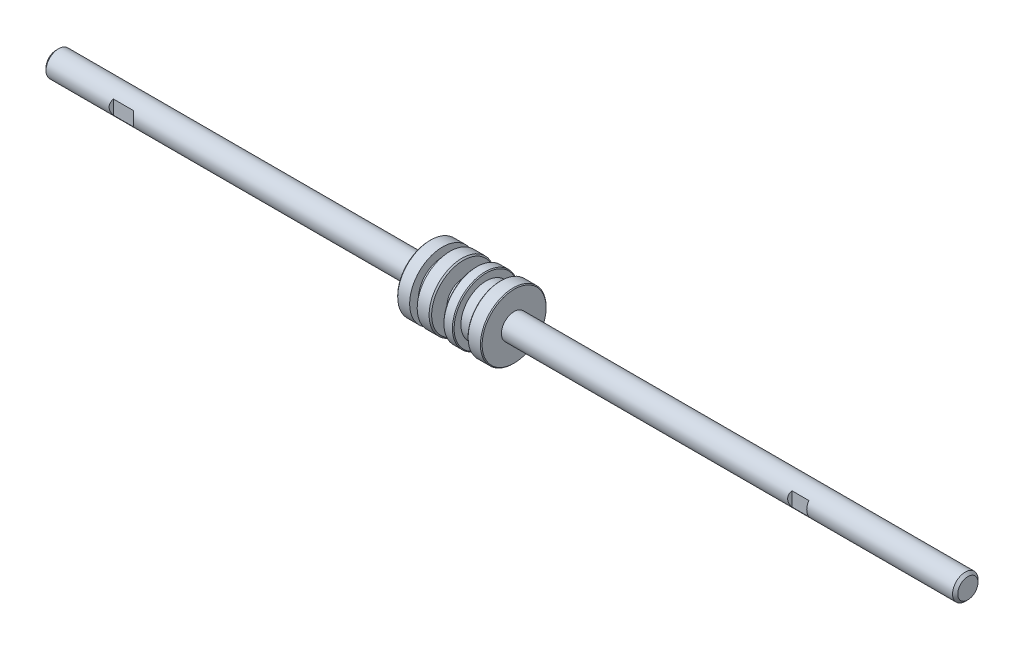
ISO-10303-21;
HEADER;
FILE_DESCRIPTION(('STEP AP214'),'2;1');
FILE_NAME('part.step','',(''),(''),'','','');
FILE_SCHEMA(('AUTOMOTIVE_DESIGN { 1 0 10303 214 1 1 1 1 }'));
ENDSEC;
DATA;
#1=APPLICATION_CONTEXT('core data for automotive mechanical design processes');
#2=APPLICATION_PROTOCOL_DEFINITION('international standard','automotive_design',2000,#1);
#3=PRODUCT_CONTEXT('',#1,'mechanical');
#4=PRODUCT('Part','Part','',(#3));
#5=PRODUCT_RELATED_PRODUCT_CATEGORY('part','',(#4));
#6=PRODUCT_DEFINITION_FORMATION('','',#4);
#7=PRODUCT_DEFINITION_CONTEXT('part definition',#1,'design');
#8=PRODUCT_DEFINITION('design','',#6,#7);
#9=PRODUCT_DEFINITION_SHAPE('','',#8);
#10=(LENGTH_UNIT() NAMED_UNIT(*) SI_UNIT(.MILLI.,.METRE.));
#11=(NAMED_UNIT(*) PLANE_ANGLE_UNIT() SI_UNIT($,.RADIAN.));
#12=(NAMED_UNIT(*) SI_UNIT($,.STERADIAN.) SOLID_ANGLE_UNIT());
#13=UNCERTAINTY_MEASURE_WITH_UNIT(LENGTH_MEASURE(1.E-05),#10,'distance_accuracy_value','');
#14=(GEOMETRIC_REPRESENTATION_CONTEXT(3) GLOBAL_UNCERTAINTY_ASSIGNED_CONTEXT((#13)) GLOBAL_UNIT_ASSIGNED_CONTEXT((#10,
#11,#12)) REPRESENTATION_CONTEXT('',''));
#15=CARTESIAN_POINT('',(0.,0.,0.));
#16=DIRECTION('',(0.,0.,1.));
#17=DIRECTION('',(1.,0.,0.));
#18=AXIS2_PLACEMENT_3D('',#15,#16,#17);
#19=CARTESIAN_POINT('',(0.,0.,0.));
#20=DIRECTION('',(1.,0.,0.));
#21=DIRECTION('',(0.,0.,-1.));
#22=AXIS2_PLACEMENT_3D('',#19,#20,#21);
#23=PLANE('',#22);
#24=CARTESIAN_POINT('',(0.,0.,0.));
#25=DIRECTION('',(1.,0.,0.));
#26=DIRECTION('',(0.,0.,-1.));
#27=AXIS2_PLACEMENT_3D('',#24,#25,#26);
#28=CIRCLE('',#27,2.38649999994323);
#29=CARTESIAN_POINT('',(0.,0.,-2.38649999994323));
#30=VERTEX_POINT('',#29);
#31=EDGE_CURVE('E20',#30,#30,#28,.T.);
#32=ORIENTED_EDGE('',*,*,#31,.F.);
#33=EDGE_LOOP('',(#32));
#34=FACE_BOUND('',#33,.T.);
#35=ADVANCED_FACE('F17',(#34),#23,.F.);
#36=CARTESIAN_POINT('',(20.8,-2.5,-2.5));
#37=DIRECTION('',(0.707106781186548,0.,0.707106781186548));
#38=DIRECTION('',(0.707106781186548,0.,-0.707106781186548));
#39=AXIS2_PLACEMENT_3D('',#36,#37,#38);
#40=PLANE('',#39);
#41=CARTESIAN_POINT('',(18.3,0.,0.));
#42=DIRECTION('',(0.707106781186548,0.,0.707106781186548));
#43=DIRECTION('',(-0.707106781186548,0.,0.707106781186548));
#44=AXIS2_PLACEMENT_3D('',#41,#42,#43);
#45=ELLIPSE('',#44,4.24264068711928,3.);
#46=CARTESIAN_POINT('',(20.8,-1.6583123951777,-2.5));
#47=VERTEX_POINT('',#46);
#48=CARTESIAN_POINT('',(20.8,1.6583123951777,-2.5));
#49=VERTEX_POINT('',#48);
#50=EDGE_CURVE('E105',#47,#49,#45,.T.);
#51=ORIENTED_EDGE('',*,*,#50,.F.);
#52=DIRECTION('',(0.,1.,0.));
#53=VECTOR('',#52,1.);
#54=CARTESIAN_POINT('',(20.8,-2.5,-2.5));
#55=LINE('',#54,#53);
#56=EDGE_CURVE('E116',#47,#49,#55,.T.);
#57=ORIENTED_EDGE('',*,*,#56,.T.);
#58=EDGE_LOOP('',(#51,#57));
#59=FACE_BOUND('',#58,.T.);
#60=ADVANCED_FACE('F368',(#59),#40,.F.);
#61=CARTESIAN_POINT('',(16.,-2.5,-2.5));
#62=DIRECTION('',(0.,0.,1.));
#63=DIRECTION('',(1.,0.,0.));
#64=AXIS2_PLACEMENT_3D('',#61,#62,#63);
#65=PLANE('',#64);
#66=DIRECTION('',(-1.,0.,0.));
#67=VECTOR('',#66,1.);
#68=CARTESIAN_POINT('',(215.,-1.65831239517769,-2.50000000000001));
#69=LINE('',#68,#67);
#70=CARTESIAN_POINT('',(16.,-1.65831239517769,-2.50000000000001));
#71=VERTEX_POINT('',#70);
#72=EDGE_CURVE('E102',#71,#47,#69,.F.);
#73=ORIENTED_EDGE('',*,*,#72,.F.);
#74=DIRECTION('',(0.,1.,0.));
#75=VECTOR('',#74,1.);
#76=CARTESIAN_POINT('',(16.,-2.5,-2.5));
#77=LINE('',#76,#75);
#78=CARTESIAN_POINT('',(16.,1.65831239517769,-2.5));
#79=VERTEX_POINT('',#78);
#80=EDGE_CURVE('E114',#71,#79,#77,.T.);
#81=ORIENTED_EDGE('',*,*,#80,.T.);
#82=DIRECTION('',(-1.,0.,0.));
#83=VECTOR('',#82,1.);
#84=CARTESIAN_POINT('',(215.,1.6583123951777,-2.5));
#85=LINE('',#84,#83);
#86=EDGE_CURVE('E188',#49,#79,#85,.T.);
#87=ORIENTED_EDGE('',*,*,#86,.F.);
#88=ORIENTED_EDGE('',*,*,#56,.F.);
#89=EDGE_LOOP('',(#73,#81,#87,#88));
#90=FACE_BOUND('',#89,.T.);
#91=ADVANCED_FACE('F365',(#90),#65,.F.);
#92=CARTESIAN_POINT('',(14.4,-2.5,-4.1));
#93=DIRECTION('',(-0.707106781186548,0.,0.707106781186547));
#94=DIRECTION('',(0.707106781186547,0.,0.707106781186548));
#95=AXIS2_PLACEMENT_3D('',#92,#93,#94);
#96=PLANE('',#95);
#97=ORIENTED_EDGE('',*,*,#80,.F.);
#98=CARTESIAN_POINT('',(18.5,0.,0.));
#99=DIRECTION('',(-0.707106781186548,0.,0.707106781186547));
#100=DIRECTION('',(-0.707106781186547,0.,-0.707106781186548));
#101=AXIS2_PLACEMENT_3D('',#98,#99,#100);
#102=ELLIPSE('',#101,4.24264068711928,3.);
#103=EDGE_CURVE('E113',#79,#71,#102,.T.);
#104=ORIENTED_EDGE('',*,*,#103,.F.);
#105=EDGE_LOOP('',(#97,#104));
#106=FACE_BOUND('',#105,.T.);
#107=ADVANCED_FACE('F361',(#106),#96,.F.);
#108=CARTESIAN_POINT('',(0.613500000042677,0.,0.));
#109=DIRECTION('',(1.,0.,0.));
#110=DIRECTION('',(0.,0.,-1.));
#111=AXIS2_PLACEMENT_3D('',#108,#109,#110);
#112=CONICAL_SURFACE('',#111,3.00000000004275,0.785398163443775);
#113=CARTESIAN_POINT('',(0.613499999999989,0.,0.));
#114=DIRECTION('',(-1.,0.,0.));
#115=DIRECTION('',(0.,0.,1.));
#116=AXIS2_PLACEMENT_3D('',#113,#114,#115);
#117=CIRCLE('',#116,3.);
#118=CARTESIAN_POINT('',(0.613499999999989,0.,3.));
#119=VERTEX_POINT('',#118);
#120=EDGE_CURVE('E110',#119,#119,#117,.F.);
#121=ORIENTED_EDGE('',*,*,#120,.F.);
#122=EDGE_LOOP('',(#121));
#123=FACE_BOUND('',#122,.T.);
#124=ORIENTED_EDGE('',*,*,#31,.T.);
#125=EDGE_LOOP('',(#124));
#126=FACE_BOUND('',#125,.T.);
#127=ADVANCED_FACE('F358',(#123,#126),#112,.T.);
#128=CARTESIAN_POINT('',(16.,-2.5,2.5));
#129=DIRECTION('',(-0.707106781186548,0.,-0.707106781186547));
#130=DIRECTION('',(-0.707106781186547,0.,0.707106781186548));
#131=AXIS2_PLACEMENT_3D('',#128,#129,#130);
#132=PLANE('',#131);
#133=CARTESIAN_POINT('',(18.5,0.,0.));
#134=DIRECTION('',(-0.707106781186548,0.,-0.707106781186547));
#135=DIRECTION('',(-0.707106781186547,0.,0.707106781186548));
#136=AXIS2_PLACEMENT_3D('',#133,#134,#135);
#137=ELLIPSE('',#136,4.24264068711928,3.);
#138=CARTESIAN_POINT('',(16.,-1.6583123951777,2.5));
#139=VERTEX_POINT('',#138);
#140=CARTESIAN_POINT('',(16.,1.6583123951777,2.5));
#141=VERTEX_POINT('',#140);
#142=EDGE_CURVE('E78',#139,#141,#137,.T.);
#143=ORIENTED_EDGE('',*,*,#142,.F.);
#144=DIRECTION('',(0.,1.,0.));
#145=VECTOR('',#144,1.);
#146=CARTESIAN_POINT('',(16.,-2.5,2.5));
#147=LINE('',#146,#145);
#148=EDGE_CURVE('E99',#139,#141,#147,.T.);
#149=ORIENTED_EDGE('',*,*,#148,.T.);
#150=EDGE_LOOP('',(#143,#149));
#151=FACE_BOUND('',#150,.T.);
#152=ADVANCED_FACE('F355',(#151),#132,.F.);
#153=CARTESIAN_POINT('',(20.8,-2.5,2.5));
#154=DIRECTION('',(0.,0.,-1.));
#155=DIRECTION('',(-1.,0.,0.));
#156=AXIS2_PLACEMENT_3D('',#153,#154,#155);
#157=PLANE('',#156);
#158=DIRECTION('',(-1.,0.,0.));
#159=VECTOR('',#158,1.);
#160=CARTESIAN_POINT('',(215.,1.6583123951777,2.5));
#161=LINE('',#160,#159);
#162=CARTESIAN_POINT('',(20.8,1.65831239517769,2.5));
#163=VERTEX_POINT('',#162);
#164=EDGE_CURVE('E92',#141,#163,#161,.F.);
#165=ORIENTED_EDGE('',*,*,#164,.F.);
#166=ORIENTED_EDGE('',*,*,#148,.F.);
#167=DIRECTION('',(-1.,0.,0.));
#168=VECTOR('',#167,1.);
#169=CARTESIAN_POINT('',(215.,-1.65831239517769,2.50000000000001));
#170=LINE('',#169,#168);
#171=CARTESIAN_POINT('',(20.8,-1.65831239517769,2.50000000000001));
#172=VERTEX_POINT('',#171);
#173=EDGE_CURVE('E90',#172,#139,#170,.T.);
#174=ORIENTED_EDGE('',*,*,#173,.F.);
#175=DIRECTION('',(0.,1.,0.));
#176=VECTOR('',#175,1.);
#177=CARTESIAN_POINT('',(20.8,-2.5,2.5));
#178=LINE('',#177,#176);
#179=EDGE_CURVE('E96',#172,#163,#178,.T.);
#180=ORIENTED_EDGE('',*,*,#179,.T.);
#181=EDGE_LOOP('',(#165,#166,#174,#180));
#182=FACE_BOUND('',#181,.T.);
#183=ADVANCED_FACE('F101',(#182),#157,.F.);
#184=CARTESIAN_POINT('',(30.3,-2.5,12.));
#185=DIRECTION('',(0.707106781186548,0.,-0.707106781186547));
#186=DIRECTION('',(-0.707106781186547,0.,-0.707106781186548));
#187=AXIS2_PLACEMENT_3D('',#184,#185,#186);
#188=PLANE('',#187);
#189=ORIENTED_EDGE('',*,*,#179,.F.);
#190=CARTESIAN_POINT('',(18.3,0.,0.));
#191=DIRECTION('',(0.707106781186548,0.,-0.707106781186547));
#192=DIRECTION('',(-0.707106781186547,0.,-0.707106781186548));
#193=AXIS2_PLACEMENT_3D('',#190,#191,#192);
#194=ELLIPSE('',#193,4.24264068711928,3.);
#195=EDGE_CURVE('E85',#163,#172,#194,.T.);
#196=ORIENTED_EDGE('',*,*,#195,.F.);
#197=EDGE_LOOP('',(#189,#196));
#198=FACE_BOUND('',#197,.T.);
#199=ADVANCED_FACE('F97',(#198),#188,.F.);
#200=CARTESIAN_POINT('',(215.,0.,0.));
#201=DIRECTION('',(-1.,0.,0.));
#202=DIRECTION('',(0.,0.,1.));
#203=AXIS2_PLACEMENT_3D('',#200,#201,#202);
#204=CYLINDRICAL_SURFACE('',#203,3.);
#205=ORIENTED_EDGE('',*,*,#72,.T.);
#206=ORIENTED_EDGE('',*,*,#50,.T.);
#207=ORIENTED_EDGE('',*,*,#86,.T.);
#208=ORIENTED_EDGE('',*,*,#103,.T.);
#209=EDGE_LOOP('',(#205,#206,#207,#208));
#210=FACE_BOUND('',#209,.T.);
#211=ORIENTED_EDGE('',*,*,#120,.T.);
#212=EDGE_LOOP('',(#211));
#213=FACE_BOUND('',#212,.T.);
#214=ORIENTED_EDGE('',*,*,#173,.T.);
#215=ORIENTED_EDGE('',*,*,#142,.T.);
#216=ORIENTED_EDGE('',*,*,#164,.T.);
#217=ORIENTED_EDGE('',*,*,#195,.T.);
#218=EDGE_LOOP('',(#214,#215,#216,#217));
#219=FACE_BOUND('',#218,.T.);
#220=CARTESIAN_POINT('',(88.,0.,0.));
#221=DIRECTION('',(-1.,0.,0.));
#222=DIRECTION('',(0.,0.,1.));
#223=AXIS2_PLACEMENT_3D('',#220,#221,#222);
#224=CIRCLE('',#223,3.);
#225=CARTESIAN_POINT('',(88.,0.,3.));
#226=VERTEX_POINT('',#225);
#227=EDGE_CURVE('E94',#226,#226,#224,.T.);
#228=ORIENTED_EDGE('',*,*,#227,.T.);
#229=EDGE_LOOP('',(#228));
#230=FACE_BOUND('',#229,.T.);
#231=ADVANCED_FACE('F87',(#210,#213,#219,#230),#204,.T.);
#232=CARTESIAN_POINT('',(88.,3.,0.));
#233=DIRECTION('',(1.,0.,0.));
#234=DIRECTION('',(0.,0.,-1.));
#235=AXIS2_PLACEMENT_3D('',#232,#233,#234);
#236=PLANE('',#235);
#237=CARTESIAN_POINT('',(88.,0.,0.));
#238=DIRECTION('',(1.,0.,0.));
#239=DIRECTION('',(0.,0.,-1.));
#240=AXIS2_PLACEMENT_3D('',#237,#238,#239);
#241=CIRCLE('',#240,7.45);
#242=CARTESIAN_POINT('',(88.,0.,-7.45));
#243=VERTEX_POINT('',#242);
#244=EDGE_CURVE('E182',#243,#243,#241,.T.);
#245=ORIENTED_EDGE('',*,*,#244,.F.);
#246=EDGE_LOOP('',(#245));
#247=FACE_BOUND('',#246,.T.);
#248=ORIENTED_EDGE('',*,*,#227,.F.);
#249=EDGE_LOOP('',(#248));
#250=FACE_BOUND('',#249,.T.);
#251=ADVANCED_FACE('F344',(#247,#250),#236,.F.);
#252=CARTESIAN_POINT('',(88.3,0.,0.));
#253=DIRECTION('',(1.,0.,0.));
#254=DIRECTION('',(0.,0.,-1.));
#255=AXIS2_PLACEMENT_3D('',#252,#253,#254);
#256=CONICAL_SURFACE('',#255,7.75,0.785398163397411);
#257=CARTESIAN_POINT('',(88.3,0.,0.));
#258=DIRECTION('',(-1.,0.,0.));
#259=DIRECTION('',(0.,0.,1.));
#260=AXIS2_PLACEMENT_3D('',#257,#258,#259);
#261=CIRCLE('',#260,7.75);
#262=CARTESIAN_POINT('',(88.3,0.,7.75));
#263=VERTEX_POINT('',#262);
#264=EDGE_CURVE('E181',#263,#263,#261,.F.);
#265=ORIENTED_EDGE('',*,*,#264,.F.);
#266=EDGE_LOOP('',(#265));
#267=FACE_BOUND('',#266,.T.);
#268=ORIENTED_EDGE('',*,*,#244,.T.);
#269=EDGE_LOOP('',(#268));
#270=FACE_BOUND('',#269,.T.);
#271=ADVANCED_FACE('F340',(#267,#270),#256,.T.);
#272=CARTESIAN_POINT('',(215.,0.,0.));
#273=DIRECTION('',(-1.,0.,0.));
#274=DIRECTION('',(0.,0.,1.));
#275=AXIS2_PLACEMENT_3D('',#272,#273,#274);
#276=CYLINDRICAL_SURFACE('',#275,7.75);
#277=ORIENTED_EDGE('',*,*,#264,.T.);
#278=EDGE_LOOP('',(#277));
#279=FACE_BOUND('',#278,.T.);
#280=CARTESIAN_POINT('',(91.11,0.,0.));
#281=DIRECTION('',(-1.,0.,0.));
#282=DIRECTION('',(0.,0.,1.));
#283=AXIS2_PLACEMENT_3D('',#280,#281,#282);
#284=CIRCLE('',#283,7.75);
#285=CARTESIAN_POINT('',(91.11,0.,7.75));
#286=VERTEX_POINT('',#285);
#287=EDGE_CURVE('E178',#286,#286,#284,.T.);
#288=ORIENTED_EDGE('',*,*,#287,.T.);
#289=EDGE_LOOP('',(#288));
#290=FACE_BOUND('',#289,.T.);
#291=ADVANCED_FACE('F336',(#279,#290),#276,.T.);
#292=CARTESIAN_POINT('',(91.11,7.75,0.));
#293=DIRECTION('',(-1.,0.,0.));
#294=DIRECTION('',(0.,0.,1.));
#295=AXIS2_PLACEMENT_3D('',#292,#293,#294);
#296=PLANE('',#295);
#297=CARTESIAN_POINT('',(91.11,0.,0.));
#298=DIRECTION('',(-1.,0.,0.));
#299=DIRECTION('',(0.,0.,1.));
#300=AXIS2_PLACEMENT_3D('',#297,#298,#299);
#301=CIRCLE('',#300,5.7);
#302=CARTESIAN_POINT('',(91.11,0.,5.7));
#303=VERTEX_POINT('',#302);
#304=EDGE_CURVE('E175',#303,#303,#301,.F.);
#305=ORIENTED_EDGE('',*,*,#304,.F.);
#306=EDGE_LOOP('',(#305));
#307=FACE_BOUND('',#306,.T.);
#308=ORIENTED_EDGE('',*,*,#287,.F.);
#309=EDGE_LOOP('',(#308));
#310=FACE_BOUND('',#309,.T.);
#311=ADVANCED_FACE('F332',(#307,#310),#296,.F.);
#312=CARTESIAN_POINT('',(215.,0.,0.));
#313=DIRECTION('',(-1.,0.,0.));
#314=DIRECTION('',(0.,0.,1.));
#315=AXIS2_PLACEMENT_3D('',#312,#313,#314);
#316=CYLINDRICAL_SURFACE('',#315,5.7);
#317=ORIENTED_EDGE('',*,*,#304,.T.);
#318=EDGE_LOOP('',(#317));
#319=FACE_BOUND('',#318,.T.);
#320=CARTESIAN_POINT('',(92.89,0.,0.));
#321=DIRECTION('',(-1.,0.,0.));
#322=DIRECTION('',(0.,0.,1.));
#323=AXIS2_PLACEMENT_3D('',#320,#321,#322);
#324=CIRCLE('',#323,5.7);
#325=CARTESIAN_POINT('',(92.89,0.,5.7));
#326=VERTEX_POINT('',#325);
#327=EDGE_CURVE('E172',#326,#326,#324,.T.);
#328=ORIENTED_EDGE('',*,*,#327,.T.);
#329=EDGE_LOOP('',(#328));
#330=FACE_BOUND('',#329,.T.);
#331=ADVANCED_FACE('F328',(#319,#330),#316,.T.);
#332=CARTESIAN_POINT('',(92.89,5.7,0.));
#333=DIRECTION('',(1.,0.,0.));
#334=DIRECTION('',(0.,0.,-1.));
#335=AXIS2_PLACEMENT_3D('',#332,#333,#334);
#336=PLANE('',#335);
#337=CARTESIAN_POINT('',(92.89,0.,0.));
#338=DIRECTION('',(-1.,0.,0.));
#339=DIRECTION('',(0.,0.,1.));
#340=AXIS2_PLACEMENT_3D('',#337,#338,#339);
#341=CIRCLE('',#340,7.75);
#342=CARTESIAN_POINT('',(92.89,0.,7.75));
#343=VERTEX_POINT('',#342);
#344=EDGE_CURVE('E169',#343,#343,#341,.F.);
#345=ORIENTED_EDGE('',*,*,#344,.F.);
#346=EDGE_LOOP('',(#345));
#347=FACE_BOUND('',#346,.T.);
#348=ORIENTED_EDGE('',*,*,#327,.F.);
#349=EDGE_LOOP('',(#348));
#350=FACE_BOUND('',#349,.T.);
#351=ADVANCED_FACE('F324',(#347,#350),#336,.F.);
#352=CARTESIAN_POINT('',(215.,0.,0.));
#353=DIRECTION('',(-1.,0.,0.));
#354=DIRECTION('',(0.,0.,1.));
#355=AXIS2_PLACEMENT_3D('',#352,#353,#354);
#356=CYLINDRICAL_SURFACE('',#355,7.75);
#357=ORIENTED_EDGE('',*,*,#344,.T.);
#358=EDGE_LOOP('',(#357));
#359=FACE_BOUND('',#358,.T.);
#360=CARTESIAN_POINT('',(95.7,0.,0.));
#361=DIRECTION('',(-1.,0.,0.));
#362=DIRECTION('',(0.,0.,1.));
#363=AXIS2_PLACEMENT_3D('',#360,#361,#362);
#364=CIRCLE('',#363,7.75);
#365=CARTESIAN_POINT('',(95.7,0.,7.75));
#366=VERTEX_POINT('',#365);
#367=EDGE_CURVE('E168',#366,#366,#364,.F.);
#368=ORIENTED_EDGE('',*,*,#367,.F.);
#369=EDGE_LOOP('',(#368));
#370=FACE_BOUND('',#369,.T.);
#371=ADVANCED_FACE('F320',(#359,#370),#356,.T.);
#372=CARTESIAN_POINT('',(95.7,0.,0.));
#373=DIRECTION('',(-1.,0.,0.));
#374=DIRECTION('',(0.,-1.,0.));
#375=AXIS2_PLACEMENT_3D('',#372,#373,#374);
#376=CONICAL_SURFACE('',#375,7.75,0.785398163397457);
#377=ORIENTED_EDGE('',*,*,#367,.T.);
#378=EDGE_LOOP('',(#377));
#379=FACE_BOUND('',#378,.T.);
#380=CARTESIAN_POINT('',(96.,0.,0.));
#381=DIRECTION('',(-1.,0.,0.));
#382=DIRECTION('',(0.,-1.,0.));
#383=AXIS2_PLACEMENT_3D('',#380,#381,#382);
#384=CIRCLE('',#383,7.45);
#385=CARTESIAN_POINT('',(96.,-7.45,0.));
#386=VERTEX_POINT('',#385);
#387=EDGE_CURVE('E165',#386,#386,#384,.T.);
#388=ORIENTED_EDGE('',*,*,#387,.T.);
#389=EDGE_LOOP('',(#388));
#390=FACE_BOUND('',#389,.T.);
#391=ADVANCED_FACE('F316',(#379,#390),#376,.T.);
#392=CARTESIAN_POINT('',(96.,7.45,0.));
#393=DIRECTION('',(-1.,0.,0.));
#394=DIRECTION('',(0.,0.,1.));
#395=AXIS2_PLACEMENT_3D('',#392,#393,#394);
#396=PLANE('',#395);
#397=CARTESIAN_POINT('',(96.,0.,0.));
#398=DIRECTION('',(-1.,0.,0.));
#399=DIRECTION('',(0.,0.,1.));
#400=AXIS2_PLACEMENT_3D('',#397,#398,#399);
#401=CIRCLE('',#400,3.85);
#402=CARTESIAN_POINT('',(96.,0.,3.85));
#403=VERTEX_POINT('',#402);
#404=EDGE_CURVE('E162',#403,#403,#401,.F.);
#405=ORIENTED_EDGE('',*,*,#404,.F.);
#406=EDGE_LOOP('',(#405));
#407=FACE_BOUND('',#406,.T.);
#408=ORIENTED_EDGE('',*,*,#387,.F.);
#409=EDGE_LOOP('',(#408));
#410=FACE_BOUND('',#409,.T.);
#411=ADVANCED_FACE('F312',(#407,#410),#396,.F.);
#412=CARTESIAN_POINT('',(215.,0.,0.));
#413=DIRECTION('',(-1.,0.,0.));
#414=DIRECTION('',(0.,0.,1.));
#415=AXIS2_PLACEMENT_3D('',#412,#413,#414);
#416=CYLINDRICAL_SURFACE('',#415,3.85);
#417=ORIENTED_EDGE('',*,*,#404,.T.);
#418=EDGE_LOOP('',(#417));
#419=FACE_BOUND('',#418,.T.);
#420=CARTESIAN_POINT('',(99.,0.,0.));
#421=DIRECTION('',(-1.,0.,0.));
#422=DIRECTION('',(0.,0.,1.));
#423=AXIS2_PLACEMENT_3D('',#420,#421,#422);
#424=CIRCLE('',#423,3.85);
#425=CARTESIAN_POINT('',(99.,0.,3.85));
#426=VERTEX_POINT('',#425);
#427=EDGE_CURVE('E159',#426,#426,#424,.T.);
#428=ORIENTED_EDGE('',*,*,#427,.T.);
#429=EDGE_LOOP('',(#428));
#430=FACE_BOUND('',#429,.T.);
#431=ADVANCED_FACE('F308',(#419,#430),#416,.T.);
#432=CARTESIAN_POINT('',(99.,3.85,0.));
#433=DIRECTION('',(1.,0.,0.));
#434=DIRECTION('',(0.,0.,-1.));
#435=AXIS2_PLACEMENT_3D('',#432,#433,#434);
#436=PLANE('',#435);
#437=CARTESIAN_POINT('',(99.,0.,0.));
#438=DIRECTION('',(1.,0.,0.));
#439=DIRECTION('',(0.,0.,-1.));
#440=AXIS2_PLACEMENT_3D('',#437,#438,#439);
#441=CIRCLE('',#440,7.54999999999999);
#442=CARTESIAN_POINT('',(99.,0.,-7.54999999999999));
#443=VERTEX_POINT('',#442);
#444=EDGE_CURVE('E155',#443,#443,#441,.T.);
#445=ORIENTED_EDGE('',*,*,#444,.F.);
#446=EDGE_LOOP('',(#445));
#447=FACE_BOUND('',#446,.T.);
#448=ORIENTED_EDGE('',*,*,#427,.F.);
#449=EDGE_LOOP('',(#448));
#450=FACE_BOUND('',#449,.T.);
#451=ADVANCED_FACE('F304',(#447,#450),#436,.F.);
#452=CARTESIAN_POINT('',(99.2,0.,0.));
#453=DIRECTION('',(1.,0.,0.));
#454=DIRECTION('',(0.,0.,-1.));
#455=AXIS2_PLACEMENT_3D('',#452,#453,#454);
#456=CONICAL_SURFACE('',#455,7.75,0.785398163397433);
#457=CARTESIAN_POINT('',(99.2,0.,0.));
#458=DIRECTION('',(-1.,0.,0.));
#459=DIRECTION('',(0.,0.,1.));
#460=AXIS2_PLACEMENT_3D('',#457,#458,#459);
#461=CIRCLE('',#460,7.75);
#462=CARTESIAN_POINT('',(99.2,0.,7.75));
#463=VERTEX_POINT('',#462);
#464=EDGE_CURVE('E158',#463,#463,#461,.F.);
#465=ORIENTED_EDGE('',*,*,#464,.F.);
#466=EDGE_LOOP('',(#465));
#467=FACE_BOUND('',#466,.T.);
#468=ORIENTED_EDGE('',*,*,#444,.T.);
#469=EDGE_LOOP('',(#468));
#470=FACE_BOUND('',#469,.T.);
#471=ADVANCED_FACE('F300',(#467,#470),#456,.T.);
#472=CARTESIAN_POINT('',(215.,0.,0.));
#473=DIRECTION('',(-1.,0.,0.));
#474=DIRECTION('',(0.,0.,1.));
#475=AXIS2_PLACEMENT_3D('',#472,#473,#474);
#476=CYLINDRICAL_SURFACE('',#475,7.75);
#477=ORIENTED_EDGE('',*,*,#464,.T.);
#478=EDGE_LOOP('',(#477));
#479=FACE_BOUND('',#478,.T.);
#480=CARTESIAN_POINT('',(101.2,0.,0.));
#481=DIRECTION('',(-1.,0.,0.));
#482=DIRECTION('',(0.,0.,1.));
#483=AXIS2_PLACEMENT_3D('',#480,#481,#482);
#484=CIRCLE('',#483,7.75);
#485=CARTESIAN_POINT('',(101.2,0.,7.75));
#486=VERTEX_POINT('',#485);
#487=EDGE_CURVE('E154',#486,#486,#484,.F.);
#488=ORIENTED_EDGE('',*,*,#487,.F.);
#489=EDGE_LOOP('',(#488));
#490=FACE_BOUND('',#489,.T.);
#491=ADVANCED_FACE('F296',(#479,#490),#476,.T.);
#492=CARTESIAN_POINT('',(101.2,0.,0.));
#493=DIRECTION('',(-1.,0.,0.));
#494=DIRECTION('',(0.,-1.,0.));
#495=AXIS2_PLACEMENT_3D('',#492,#493,#494);
#496=CONICAL_SURFACE('',#495,7.75,0.785398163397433);
#497=ORIENTED_EDGE('',*,*,#487,.T.);
#498=EDGE_LOOP('',(#497));
#499=FACE_BOUND('',#498,.T.);
#500=CARTESIAN_POINT('',(101.4,0.,0.));
#501=DIRECTION('',(-1.,0.,0.));
#502=DIRECTION('',(0.,-1.,0.));
#503=AXIS2_PLACEMENT_3D('',#500,#501,#502);
#504=CIRCLE('',#503,7.55);
#505=CARTESIAN_POINT('',(101.4,-7.55,0.));
#506=VERTEX_POINT('',#505);
#507=EDGE_CURVE('E151',#506,#506,#504,.T.);
#508=ORIENTED_EDGE('',*,*,#507,.T.);
#509=EDGE_LOOP('',(#508));
#510=FACE_BOUND('',#509,.T.);
#511=ADVANCED_FACE('F292',(#499,#510),#496,.T.);
#512=CARTESIAN_POINT('',(101.4,7.55,0.));
#513=DIRECTION('',(-1.,0.,0.));
#514=DIRECTION('',(0.,0.,1.));
#515=AXIS2_PLACEMENT_3D('',#512,#513,#514);
#516=PLANE('',#515);
#517=CARTESIAN_POINT('',(101.4,0.,0.));
#518=DIRECTION('',(-1.,0.,0.));
#519=DIRECTION('',(0.,0.,1.));
#520=AXIS2_PLACEMENT_3D('',#517,#518,#519);
#521=CIRCLE('',#520,5.95);
#522=CARTESIAN_POINT('',(101.4,0.,5.95));
#523=VERTEX_POINT('',#522);
#524=EDGE_CURVE('E148',#523,#523,#521,.F.);
#525=ORIENTED_EDGE('',*,*,#524,.F.);
#526=EDGE_LOOP('',(#525));
#527=FACE_BOUND('',#526,.T.);
#528=ORIENTED_EDGE('',*,*,#507,.F.);
#529=EDGE_LOOP('',(#528));
#530=FACE_BOUND('',#529,.T.);
#531=ADVANCED_FACE('F288',(#527,#530),#516,.F.);
#532=CARTESIAN_POINT('',(215.,0.,0.));
#533=DIRECTION('',(-1.,0.,0.));
#534=DIRECTION('',(0.,0.,1.));
#535=AXIS2_PLACEMENT_3D('',#532,#533,#534);
#536=CYLINDRICAL_SURFACE('',#535,5.95);
#537=ORIENTED_EDGE('',*,*,#524,.T.);
#538=EDGE_LOOP('',(#537));
#539=FACE_BOUND('',#538,.T.);
#540=CARTESIAN_POINT('',(104.7,0.,0.));
#541=DIRECTION('',(-1.,0.,0.));
#542=DIRECTION('',(0.,0.,1.));
#543=AXIS2_PLACEMENT_3D('',#540,#541,#542);
#544=CIRCLE('',#543,5.95);
#545=CARTESIAN_POINT('',(104.7,0.,5.95));
#546=VERTEX_POINT('',#545);
#547=EDGE_CURVE('E145',#546,#546,#544,.T.);
#548=ORIENTED_EDGE('',*,*,#547,.T.);
#549=EDGE_LOOP('',(#548));
#550=FACE_BOUND('',#549,.T.);
#551=ADVANCED_FACE('F284',(#539,#550),#536,.T.);
#552=CARTESIAN_POINT('',(104.7,5.95,0.));
#553=DIRECTION('',(1.,0.,0.));
#554=DIRECTION('',(0.,0.,-1.));
#555=AXIS2_PLACEMENT_3D('',#552,#553,#554);
#556=PLANE('',#555);
#557=CARTESIAN_POINT('',(104.7,0.,0.));
#558=DIRECTION('',(1.,0.,0.));
#559=DIRECTION('',(0.,1.,0.));
#560=AXIS2_PLACEMENT_3D('',#557,#558,#559);
#561=CIRCLE('',#560,7.55);
#562=CARTESIAN_POINT('',(104.7,7.55,0.));
#563=VERTEX_POINT('',#562);
#564=EDGE_CURVE('E141',#563,#563,#561,.T.);
#565=ORIENTED_EDGE('',*,*,#564,.F.);
#566=EDGE_LOOP('',(#565));
#567=FACE_BOUND('',#566,.T.);
#568=ORIENTED_EDGE('',*,*,#547,.F.);
#569=EDGE_LOOP('',(#568));
#570=FACE_BOUND('',#569,.T.);
#571=ADVANCED_FACE('F280',(#567,#570),#556,.F.);
#572=CARTESIAN_POINT('',(104.9,0.,0.));
#573=DIRECTION('',(1.,0.,0.));
#574=DIRECTION('',(0.,1.,0.));
#575=AXIS2_PLACEMENT_3D('',#572,#573,#574);
#576=CONICAL_SURFACE('',#575,7.75,0.785398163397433);
#577=CARTESIAN_POINT('',(104.9,0.,0.));
#578=DIRECTION('',(-1.,0.,0.));
#579=DIRECTION('',(0.,0.,1.));
#580=AXIS2_PLACEMENT_3D('',#577,#578,#579);
#581=CIRCLE('',#580,7.75);
#582=CARTESIAN_POINT('',(104.9,0.,7.75));
#583=VERTEX_POINT('',#582);
#584=EDGE_CURVE('E144',#583,#583,#581,.F.);
#585=ORIENTED_EDGE('',*,*,#584,.F.);
#586=EDGE_LOOP('',(#585));
#587=FACE_BOUND('',#586,.T.);
#588=ORIENTED_EDGE('',*,*,#564,.T.);
#589=EDGE_LOOP('',(#588));
#590=FACE_BOUND('',#589,.T.);
#591=ADVANCED_FACE('F276',(#587,#590),#576,.T.);
#592=CARTESIAN_POINT('',(215.,0.,0.));
#593=DIRECTION('',(-1.,0.,0.));
#594=DIRECTION('',(0.,0.,1.));
#595=AXIS2_PLACEMENT_3D('',#592,#593,#594);
#596=CYLINDRICAL_SURFACE('',#595,7.75);
#597=ORIENTED_EDGE('',*,*,#584,.T.);
#598=EDGE_LOOP('',(#597));
#599=FACE_BOUND('',#598,.T.);
#600=CARTESIAN_POINT('',(107.8,0.,0.));
#601=DIRECTION('',(-1.,0.,0.));
#602=DIRECTION('',(0.,0.,1.));
#603=AXIS2_PLACEMENT_3D('',#600,#601,#602);
#604=CIRCLE('',#603,7.75);
#605=CARTESIAN_POINT('',(107.8,0.,7.75));
#606=VERTEX_POINT('',#605);
#607=EDGE_CURVE('E140',#606,#606,#604,.F.);
#608=ORIENTED_EDGE('',*,*,#607,.F.);
#609=EDGE_LOOP('',(#608));
#610=FACE_BOUND('',#609,.T.);
#611=ADVANCED_FACE('F269',(#599,#610),#596,.T.);
#612=CARTESIAN_POINT('',(215.,2.3865,0.));
#613=DIRECTION('',(-1.,0.,0.));
#614=DIRECTION('',(0.,0.,1.));
#615=AXIS2_PLACEMENT_3D('',#612,#613,#614);
#616=PLANE('',#615);
#617=CARTESIAN_POINT('',(215.000000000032,0.,0.));
#618=DIRECTION('',(-1.,0.,0.));
#619=DIRECTION('',(0.,0.,1.));
#620=AXIS2_PLACEMENT_3D('',#617,#618,#619);
#621=CIRCLE('',#620,2.38649999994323);
#622=CARTESIAN_POINT('',(215.000000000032,0.,2.38649999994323));
#623=VERTEX_POINT('',#622);
#624=EDGE_CURVE('E136',#623,#623,#621,.T.);
#625=ORIENTED_EDGE('',*,*,#624,.F.);
#626=EDGE_LOOP('',(#625));
#627=FACE_BOUND('',#626,.T.);
#628=ADVANCED_FACE('F259',(#627),#616,.F.);
#629=CARTESIAN_POINT('',(107.8,0.,0.));
#630=DIRECTION('',(-1.,0.,0.));
#631=DIRECTION('',(0.,0.,1.));
#632=AXIS2_PLACEMENT_3D('',#629,#630,#631);
#633=CONICAL_SURFACE('',#632,7.75,0.785398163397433);
#634=ORIENTED_EDGE('',*,*,#607,.T.);
#635=EDGE_LOOP('',(#634));
#636=FACE_BOUND('',#635,.T.);
#637=CARTESIAN_POINT('',(108.,0.,0.));
#638=DIRECTION('',(-1.,0.,0.));
#639=DIRECTION('',(0.,0.,1.));
#640=AXIS2_PLACEMENT_3D('',#637,#638,#639);
#641=CIRCLE('',#640,7.55);
#642=CARTESIAN_POINT('',(108.,0.,7.55));
#643=VERTEX_POINT('',#642);
#644=EDGE_CURVE('E131',#643,#643,#641,.T.);
#645=ORIENTED_EDGE('',*,*,#644,.T.);
#646=EDGE_LOOP('',(#645));
#647=FACE_BOUND('',#646,.T.);
#648=ADVANCED_FACE('F256',(#636,#647),#633,.T.);
#649=CARTESIAN_POINT('',(214.386499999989,0.,0.));
#650=DIRECTION('',(-1.,0.,0.));
#651=DIRECTION('',(0.,0.,1.));
#652=AXIS2_PLACEMENT_3D('',#649,#650,#651);
#653=CONICAL_SURFACE('',#652,2.9999999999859,0.785398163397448);
#654=CARTESIAN_POINT('',(214.3865,0.,0.));
#655=DIRECTION('',(-1.,0.,0.));
#656=DIRECTION('',(0.,0.,1.));
#657=AXIS2_PLACEMENT_3D('',#654,#655,#656);
#658=CIRCLE('',#657,3.);
#659=CARTESIAN_POINT('',(214.3865,0.,3.));
#660=VERTEX_POINT('',#659);
#661=EDGE_CURVE('E130',#660,#660,#658,.T.);
#662=ORIENTED_EDGE('',*,*,#661,.F.);
#663=EDGE_LOOP('',(#662));
#664=FACE_BOUND('',#663,.T.);
#665=ORIENTED_EDGE('',*,*,#624,.T.);
#666=EDGE_LOOP('',(#665));
#667=FACE_BOUND('',#666,.T.);
#668=ADVANCED_FACE('F258',(#664,#667),#653,.T.);
#669=CARTESIAN_POINT('',(180.,-2.5,-2.5));
#670=DIRECTION('',(1.,0.,0.));
#671=DIRECTION('',(0.,0.,-1.));
#672=AXIS2_PLACEMENT_3D('',#669,#670,#671);
#673=PLANE('',#672);
#674=CARTESIAN_POINT('',(180.,0.,0.));
#675=DIRECTION('',(-1.,0.,0.));
#676=DIRECTION('',(0.,0.,1.));
#677=AXIS2_PLACEMENT_3D('',#674,#675,#676);
#678=CIRCLE('',#677,3.);
#679=CARTESIAN_POINT('',(180.,-1.6583123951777,-2.5));
#680=VERTEX_POINT('',#679);
#681=CARTESIAN_POINT('',(180.,1.6583123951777,-2.5));
#682=VERTEX_POINT('',#681);
#683=EDGE_CURVE('E127',#680,#682,#678,.F.);
#684=ORIENTED_EDGE('',*,*,#683,.F.);
#685=DIRECTION('',(0.,1.,0.));
#686=VECTOR('',#685,1.);
#687=CARTESIAN_POINT('',(180.,-2.5,-2.5));
#688=LINE('',#687,#686);
#689=EDGE_CURVE('E139',#680,#682,#688,.T.);
#690=ORIENTED_EDGE('',*,*,#689,.T.);
#691=EDGE_LOOP('',(#684,#690));
#692=FACE_BOUND('',#691,.T.);
#693=ADVANCED_FACE('F266',(#692),#673,.F.);
#694=CARTESIAN_POINT('',(176.,-2.5,-2.5));
#695=DIRECTION('',(0.,0.,1.));
#696=DIRECTION('',(1.,0.,0.));
#697=AXIS2_PLACEMENT_3D('',#694,#695,#696);
#698=PLANE('',#697);
#699=DIRECTION('',(-1.,0.,0.));
#700=VECTOR('',#699,1.);
#701=CARTESIAN_POINT('',(215.,-1.6583123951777,-2.5));
#702=LINE('',#701,#700);
#703=CARTESIAN_POINT('',(176.,-1.6583123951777,-2.5));
#704=VERTEX_POINT('',#703);
#705=EDGE_CURVE('E209',#704,#680,#702,.F.);
#706=ORIENTED_EDGE('',*,*,#705,.F.);
#707=DIRECTION('',(0.,1.,0.));
#708=VECTOR('',#707,1.);
#709=CARTESIAN_POINT('',(176.,-2.5,-2.5));
#710=LINE('',#709,#708);
#711=CARTESIAN_POINT('',(176.,1.6583123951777,-2.5));
#712=VERTEX_POINT('',#711);
#713=EDGE_CURVE('E135',#704,#712,#710,.T.);
#714=ORIENTED_EDGE('',*,*,#713,.T.);
#715=DIRECTION('',(-1.,0.,0.));
#716=VECTOR('',#715,1.);
#717=CARTESIAN_POINT('',(215.,1.6583123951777,-2.5));
#718=LINE('',#717,#716);
#719=EDGE_CURVE('E126',#682,#712,#718,.T.);
#720=ORIENTED_EDGE('',*,*,#719,.F.);
#721=ORIENTED_EDGE('',*,*,#689,.F.);
#722=EDGE_LOOP('',(#706,#714,#720,#721));
#723=FACE_BOUND('',#722,.T.);
#724=ADVANCED_FACE('F579',(#723),#698,.F.);
#725=CARTESIAN_POINT('',(166.5,-2.5,-12.));
#726=DIRECTION('',(-0.707106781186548,0.,0.707106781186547));
#727=DIRECTION('',(0.707106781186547,0.,0.707106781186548));
#728=AXIS2_PLACEMENT_3D('',#725,#726,#727);
#729=PLANE('',#728);
#730=ORIENTED_EDGE('',*,*,#713,.F.);
#731=CARTESIAN_POINT('',(178.5,0.,0.));
#732=DIRECTION('',(-0.707106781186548,0.,0.707106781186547));
#733=DIRECTION('',(-0.707106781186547,0.,-0.707106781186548));
#734=AXIS2_PLACEMENT_3D('',#731,#732,#733);
#735=ELLIPSE('',#734,4.24264068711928,3.);
#736=EDGE_CURVE('E124',#712,#704,#735,.T.);
#737=ORIENTED_EDGE('',*,*,#736,.F.);
#738=EDGE_LOOP('',(#730,#737));
#739=FACE_BOUND('',#738,.T.);
#740=ADVANCED_FACE('F239',(#739),#729,.F.);
#741=CARTESIAN_POINT('',(108.,7.55,0.));
#742=DIRECTION('',(-1.,0.,0.));
#743=DIRECTION('',(0.,0.,1.));
#744=AXIS2_PLACEMENT_3D('',#741,#742,#743);
#745=PLANE('',#744);
#746=CARTESIAN_POINT('',(108.,0.,0.));
#747=DIRECTION('',(-1.,0.,0.));
#748=DIRECTION('',(0.,0.,1.));
#749=AXIS2_PLACEMENT_3D('',#746,#747,#748);
#750=CIRCLE('',#749,3.);
#751=CARTESIAN_POINT('',(108.,0.,3.));
#752=VERTEX_POINT('',#751);
#753=EDGE_CURVE('E121',#752,#752,#750,.F.);
#754=ORIENTED_EDGE('',*,*,#753,.F.);
#755=EDGE_LOOP('',(#754));
#756=FACE_BOUND('',#755,.T.);
#757=ORIENTED_EDGE('',*,*,#644,.F.);
#758=EDGE_LOOP('',(#757));
#759=FACE_BOUND('',#758,.T.);
#760=ADVANCED_FACE('F230',(#756,#759),#745,.F.);
#761=CARTESIAN_POINT('',(176.,-2.5,2.5));
#762=DIRECTION('',(-0.707106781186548,0.,-0.707106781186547));
#763=DIRECTION('',(-0.707106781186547,0.,0.707106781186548));
#764=AXIS2_PLACEMENT_3D('',#761,#762,#763);
#765=PLANE('',#764);
#766=CARTESIAN_POINT('',(178.5,0.,0.));
#767=DIRECTION('',(-0.707106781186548,0.,-0.707106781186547));
#768=DIRECTION('',(-0.707106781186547,0.,0.707106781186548));
#769=AXIS2_PLACEMENT_3D('',#766,#767,#768);
#770=ELLIPSE('',#769,4.24264068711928,3.);
#771=CARTESIAN_POINT('',(176.,-1.6583123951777,2.5));
#772=VERTEX_POINT('',#771);
#773=CARTESIAN_POINT('',(176.,1.6583123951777,2.5));
#774=VERTEX_POINT('',#773);
#775=EDGE_CURVE('E118',#772,#774,#770,.T.);
#776=ORIENTED_EDGE('',*,*,#775,.F.);
#777=DIRECTION('',(0.,1.,0.));
#778=VECTOR('',#777,1.);
#779=CARTESIAN_POINT('',(176.,-2.5,2.5));
#780=LINE('',#779,#778);
#781=EDGE_CURVE('E134',#772,#774,#780,.T.);
#782=ORIENTED_EDGE('',*,*,#781,.T.);
#783=EDGE_LOOP('',(#776,#782));
#784=FACE_BOUND('',#783,.T.);
#785=ADVANCED_FACE('F228',(#784),#765,.F.);
#786=CARTESIAN_POINT('',(180.,-2.5,2.5));
#787=DIRECTION('',(0.,0.,-1.));
#788=DIRECTION('',(-1.,0.,0.));
#789=AXIS2_PLACEMENT_3D('',#786,#787,#788);
#790=PLANE('',#789);
#791=DIRECTION('',(-1.,0.,0.));
#792=VECTOR('',#791,1.);
#793=CARTESIAN_POINT('',(215.,1.6583123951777,2.5));
#794=LINE('',#793,#792);
#795=CARTESIAN_POINT('',(180.,1.6583123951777,2.5));
#796=VERTEX_POINT('',#795);
#797=EDGE_CURVE('E26',#774,#796,#794,.F.);
#798=ORIENTED_EDGE('',*,*,#797,.F.);
#799=ORIENTED_EDGE('',*,*,#781,.F.);
#800=DIRECTION('',(-1.,0.,0.));
#801=VECTOR('',#800,1.);
#802=CARTESIAN_POINT('',(215.,-1.6583123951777,2.5));
#803=LINE('',#802,#801);
#804=CARTESIAN_POINT('',(180.,-1.6583123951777,2.5));
#805=VERTEX_POINT('',#804);
#806=EDGE_CURVE('E214',#805,#772,#803,.T.);
#807=ORIENTED_EDGE('',*,*,#806,.F.);
#808=DIRECTION('',(0.,1.,0.));
#809=VECTOR('',#808,1.);
#810=CARTESIAN_POINT('',(180.,-2.5,2.5));
#811=LINE('',#810,#809);
#812=EDGE_CURVE('E35',#805,#796,#811,.T.);
#813=ORIENTED_EDGE('',*,*,#812,.T.);
#814=EDGE_LOOP('',(#798,#799,#807,#813));
#815=FACE_BOUND('',#814,.T.);
#816=ADVANCED_FACE('F226',(#815),#790,.F.);
#817=CARTESIAN_POINT('',(180.,-2.5,10.));
#818=DIRECTION('',(1.,0.,0.));
#819=DIRECTION('',(0.,0.,-1.));
#820=AXIS2_PLACEMENT_3D('',#817,#818,#819);
#821=PLANE('',#820);
#822=ORIENTED_EDGE('',*,*,#812,.F.);
#823=CARTESIAN_POINT('',(180.,0.,0.));
#824=DIRECTION('',(-1.,0.,0.));
#825=DIRECTION('',(0.,0.,1.));
#826=AXIS2_PLACEMENT_3D('',#823,#824,#825);
#827=CIRCLE('',#826,3.);
#828=EDGE_CURVE('E11',#796,#805,#827,.F.);
#829=ORIENTED_EDGE('',*,*,#828,.F.);
#830=EDGE_LOOP('',(#822,#829));
#831=FACE_BOUND('',#830,.T.);
#832=ADVANCED_FACE('F237',(#831),#821,.F.);
#833=CARTESIAN_POINT('',(215.,0.,0.));
#834=DIRECTION('',(-1.,0.,0.));
#835=DIRECTION('',(0.,0.,1.));
#836=AXIS2_PLACEMENT_3D('',#833,#834,#835);
#837=CYLINDRICAL_SURFACE('',#836,3.);
#838=ORIENTED_EDGE('',*,*,#705,.T.);
#839=ORIENTED_EDGE('',*,*,#683,.T.);
#840=ORIENTED_EDGE('',*,*,#719,.T.);
#841=ORIENTED_EDGE('',*,*,#736,.T.);
#842=EDGE_LOOP('',(#838,#839,#840,#841));
#843=FACE_BOUND('',#842,.T.);
#844=ORIENTED_EDGE('',*,*,#753,.T.);
#845=EDGE_LOOP('',(#844));
#846=FACE_BOUND('',#845,.T.);
#847=ORIENTED_EDGE('',*,*,#806,.T.);
#848=ORIENTED_EDGE('',*,*,#775,.T.);
#849=ORIENTED_EDGE('',*,*,#797,.T.);
#850=ORIENTED_EDGE('',*,*,#828,.T.);
#851=EDGE_LOOP('',(#847,#848,#849,#850));
#852=FACE_BOUND('',#851,.T.);
#853=ORIENTED_EDGE('',*,*,#661,.T.);
#854=EDGE_LOOP('',(#853));
#855=FACE_BOUND('',#854,.T.);
#856=ADVANCED_FACE('F223',(#843,#846,#852,#855),#837,.T.);
#857=CLOSED_SHELL('',(#35,#60,#91,#107,#127,#152,#183,#199,#231,#251,#271,#291,#311,#331,#351,
#371,#391,#411,#431,#451,#471,#491,#511,#531,#551,#571,#591,#611,#628,#648,#668,#693,#724,#740,
#760,#785,#816,#832,#856));
#858=MANIFOLD_SOLID_BREP('B1',#857);
#859=ADVANCED_BREP_SHAPE_REPRESENTATION('',(#18,#858),#14);
#860=SHAPE_DEFINITION_REPRESENTATION(#9,#859);
ENDSEC;
END-ISO-10303-21;
